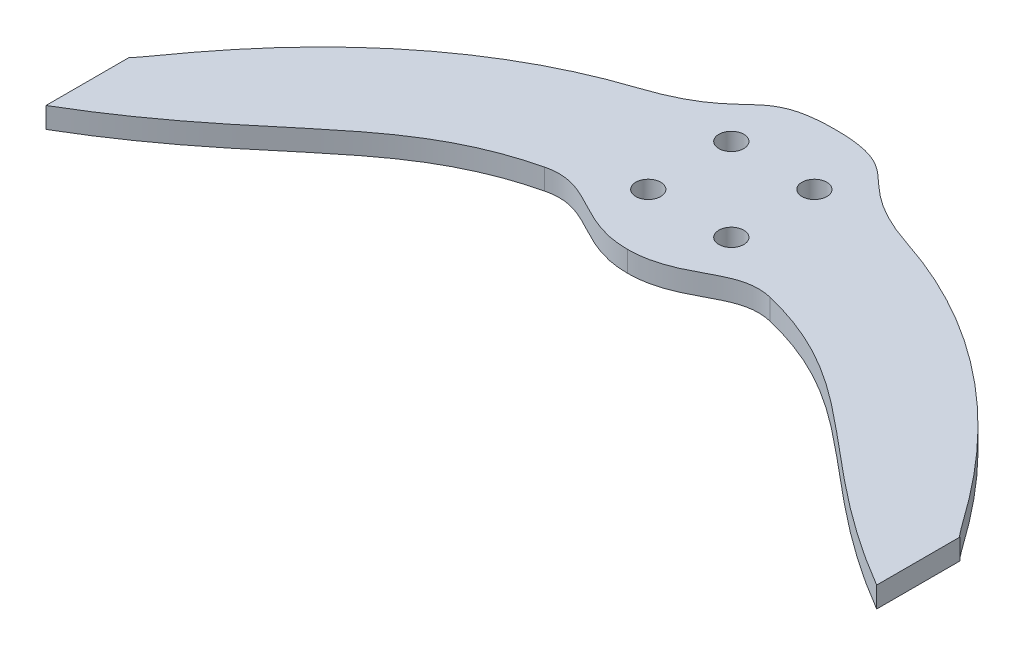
ISO-10303-21;
HEADER;
FILE_DESCRIPTION(('STEP AP214'),'2;1');
FILE_NAME('part.step','',(''),(''),'','','');
FILE_SCHEMA(('AUTOMOTIVE_DESIGN { 1 0 10303 214 1 1 1 1 }'));
ENDSEC;
DATA;
#1=APPLICATION_CONTEXT('core data for automotive mechanical design processes');
#2=APPLICATION_PROTOCOL_DEFINITION('international standard','automotive_design',2000,#1);
#3=PRODUCT_CONTEXT('',#1,'mechanical');
#4=PRODUCT('Part','Part','',(#3));
#5=PRODUCT_RELATED_PRODUCT_CATEGORY('part','',(#4));
#6=PRODUCT_DEFINITION_FORMATION('','',#4);
#7=PRODUCT_DEFINITION_CONTEXT('part definition',#1,'design');
#8=PRODUCT_DEFINITION('design','',#6,#7);
#9=PRODUCT_DEFINITION_SHAPE('','',#8);
#10=(LENGTH_UNIT() NAMED_UNIT(*) SI_UNIT(.MILLI.,.METRE.));
#11=(NAMED_UNIT(*) PLANE_ANGLE_UNIT() SI_UNIT($,.RADIAN.));
#12=(NAMED_UNIT(*) SI_UNIT($,.STERADIAN.) SOLID_ANGLE_UNIT());
#13=UNCERTAINTY_MEASURE_WITH_UNIT(LENGTH_MEASURE(1.E-05),#10,'distance_accuracy_value','');
#14=(GEOMETRIC_REPRESENTATION_CONTEXT(3) GLOBAL_UNCERTAINTY_ASSIGNED_CONTEXT((#13)) GLOBAL_UNIT_ASSIGNED_CONTEXT((#10,
#11,#12)) REPRESENTATION_CONTEXT('',''));
#15=CARTESIAN_POINT('',(0.,0.,0.));
#16=DIRECTION('',(0.,0.,1.));
#17=DIRECTION('',(1.,0.,0.));
#18=AXIS2_PLACEMENT_3D('',#15,#16,#17);
#19=CARTESIAN_POINT('',(-50.,2.5,0.));
#20=DIRECTION('',(1.,0.,0.));
#21=DIRECTION('',(0.,0.,-1.));
#22=AXIS2_PLACEMENT_3D('',#19,#20,#21);
#23=PLANE('',#22);
#24=DIRECTION('',(0.,0.,1.));
#25=VECTOR('',#24,1.);
#26=CARTESIAN_POINT('',(-50.,0.,0.));
#27=LINE('',#26,#25);
#28=CARTESIAN_POINT('',(-50.,0.,30.));
#29=VERTEX_POINT('',#28);
#30=CARTESIAN_POINT('',(-50.,0.,40.));
#31=VERTEX_POINT('',#30);
#32=EDGE_CURVE('E141',#29,#31,#27,.T.);
#33=ORIENTED_EDGE('',*,*,#32,.T.);
#34=DIRECTION('',(0.,-1.,0.));
#35=VECTOR('',#34,1.);
#36=CARTESIAN_POINT('',(-50.,2.5,40.));
#37=LINE('',#36,#35);
#38=CARTESIAN_POINT('',(-50.,2.5,40.));
#39=VERTEX_POINT('',#38);
#40=EDGE_CURVE('E11',#39,#31,#37,.T.);
#41=ORIENTED_EDGE('',*,*,#40,.F.);
#42=DIRECTION('',(0.,0.,1.));
#43=VECTOR('',#42,1.);
#44=CARTESIAN_POINT('',(-50.,2.5,0.));
#45=LINE('',#44,#43);
#46=CARTESIAN_POINT('',(-50.,2.5,30.));
#47=VERTEX_POINT('',#46);
#48=EDGE_CURVE('E228',#47,#39,#45,.T.);
#49=ORIENTED_EDGE('',*,*,#48,.F.);
#50=DIRECTION('',(0.,-1.,0.));
#51=VECTOR('',#50,1.);
#52=CARTESIAN_POINT('',(-50.,2.5,30.));
#53=LINE('',#52,#51);
#54=EDGE_CURVE('E191',#47,#29,#53,.T.);
#55=ORIENTED_EDGE('',*,*,#54,.T.);
#56=EDGE_LOOP('',(#33,#41,#49,#55));
#57=FACE_BOUND('',#56,.T.);
#58=ADVANCED_FACE('F40',(#57),#23,.F.);
#59=CARTESIAN_POINT('',(-50.,2.5,40.));
#60=CARTESIAN_POINT('',(-28.1511128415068,2.5,27.210470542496));
#61=CARTESIAN_POINT('',(-26.8264578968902,2.5,15.));
#62=CARTESIAN_POINT('',(0.,2.5,15.));
#63=B_SPLINE_CURVE_WITH_KNOTS('',3,(#59,#60,#61,#62),.UNSPECIFIED.,.F.,.F.,(4,4),(0.,1.),.UNSPECIFIED.);
#64=DIRECTION('',(0.,-1.,0.));
#65=VECTOR('',#64,1.);
#66=SURFACE_OF_LINEAR_EXTRUSION('',#63,#65);
#67=CARTESIAN_POINT('',(-50.,0.,40.));
#68=CARTESIAN_POINT('',(-28.1511128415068,0.,27.210470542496));
#69=CARTESIAN_POINT('',(-26.8264578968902,0.,15.));
#70=CARTESIAN_POINT('',(0.,0.,15.));
#71=B_SPLINE_CURVE_WITH_KNOTS('',3,(#67,#68,#69,#70),.UNSPECIFIED.,.F.,.F.,(4,4),(0.,1.),.UNSPECIFIED.);
#72=CARTESIAN_POINT('',(-13.5823718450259,0.,16.4153508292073));
#73=VERTEX_POINT('',#72);
#74=EDGE_CURVE('E202',#31,#73,#71,.T.);
#75=ORIENTED_EDGE('',*,*,#74,.T.);
#76=DIRECTION('',(0.,-1.,0.));
#77=VECTOR('',#76,1.);
#78=CARTESIAN_POINT('',(-13.5823718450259,2.5,16.4153508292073));
#79=LINE('',#78,#77);
#80=CARTESIAN_POINT('',(-13.5823718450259,2.5,16.4153508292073));
#81=VERTEX_POINT('',#80);
#82=EDGE_CURVE('E48',#81,#73,#79,.T.);
#83=ORIENTED_EDGE('',*,*,#82,.F.);
#84=EDGE_CURVE('E86',#39,#81,#63,.T.);
#85=ORIENTED_EDGE('',*,*,#84,.F.);
#86=ORIENTED_EDGE('',*,*,#40,.T.);
#87=EDGE_LOOP('',(#75,#83,#85,#86));
#88=FACE_BOUND('',#87,.T.);
#89=ADVANCED_FACE('F265',(#88),#66,.F.);
#90=CARTESIAN_POINT('',(-13.5849192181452,2.5,16.4159728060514));
#91=CARTESIAN_POINT('',(-8.61398085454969,2.5,15.2020759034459));
#92=CARTESIAN_POINT('',(-6.29609263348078,2.5,20.));
#93=CARTESIAN_POINT('',(0.,2.5,20.));
#94=B_SPLINE_CURVE_WITH_KNOTS('',3,(#90,#91,#92,#93),.UNSPECIFIED.,.F.,.F.,(4,4),(0.,1.),.UNSPECIFIED.);
#95=DIRECTION('',(0.,-1.,0.));
#96=VECTOR('',#95,1.);
#97=SURFACE_OF_LINEAR_EXTRUSION('',#94,#96);
#98=CARTESIAN_POINT('',(-13.5849192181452,0.,16.4159728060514));
#99=CARTESIAN_POINT('',(-8.61398085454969,0.,15.2020759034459));
#100=CARTESIAN_POINT('',(-6.29609263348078,0.,20.));
#101=CARTESIAN_POINT('',(0.,0.,20.));
#102=B_SPLINE_CURVE_WITH_KNOTS('',3,(#98,#99,#100,#101),.UNSPECIFIED.,.F.,.F.,(4,4),(0.,1.),.UNSPECIFIED.);
#103=CARTESIAN_POINT('',(0.,0.,20.));
#104=VERTEX_POINT('',#103);
#105=EDGE_CURVE('E206',#73,#104,#102,.T.);
#106=ORIENTED_EDGE('',*,*,#105,.T.);
#107=DIRECTION('',(0.,-1.,0.));
#108=VECTOR('',#107,1.);
#109=CARTESIAN_POINT('',(0.,2.5,20.));
#110=LINE('',#109,#108);
#111=CARTESIAN_POINT('',(0.,2.5,20.));
#112=VERTEX_POINT('',#111);
#113=EDGE_CURVE('E246',#112,#104,#110,.T.);
#114=ORIENTED_EDGE('',*,*,#113,.F.);
#115=EDGE_CURVE('E239',#81,#112,#94,.T.);
#116=ORIENTED_EDGE('',*,*,#115,.F.);
#117=ORIENTED_EDGE('',*,*,#82,.T.);
#118=EDGE_LOOP('',(#106,#114,#116,#117));
#119=FACE_BOUND('',#118,.T.);
#120=ADVANCED_FACE('F237',(#119),#97,.F.);
#121=CARTESIAN_POINT('',(-16.2793418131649,2.5,2.57520447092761));
#122=CARTESIAN_POINT('',(-5.87044346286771,2.5,-0.841962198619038));
#123=CARTESIAN_POINT('',(-9.22108648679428,2.5,-5.00000000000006));
#124=CARTESIAN_POINT('',(0.,2.5,-5.));
#125=B_SPLINE_CURVE_WITH_KNOTS('',3,(#121,#122,#123,#124),.UNSPECIFIED.,.F.,.F.,(4,4),(0.,1.),.UNSPECIFIED.);
#126=DIRECTION('',(0.,-1.,0.));
#127=VECTOR('',#126,1.);
#128=SURFACE_OF_LINEAR_EXTRUSION('',#125,#127);
#129=CARTESIAN_POINT('',(-16.2793418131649,0.,2.57520447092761));
#130=CARTESIAN_POINT('',(-5.87044346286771,0.,-0.841962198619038));
#131=CARTESIAN_POINT('',(-9.22108648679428,0.,-5.00000000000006));
#132=CARTESIAN_POINT('',(0.,0.,-5.));
#133=B_SPLINE_CURVE_WITH_KNOTS('',3,(#129,#130,#131,#132),.UNSPECIFIED.,.F.,.F.,(4,4),(0.,1.),.UNSPECIFIED.);
#134=CARTESIAN_POINT('',(-16.2724159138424,0.,2.5729312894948));
#135=VERTEX_POINT('',#134);
#136=CARTESIAN_POINT('',(0.,0.,-5.));
#137=VERTEX_POINT('',#136);
#138=EDGE_CURVE('E214',#135,#137,#133,.T.);
#139=ORIENTED_EDGE('',*,*,#138,.F.);
#140=DIRECTION('',(0.,-1.,0.));
#141=VECTOR('',#140,1.);
#142=CARTESIAN_POINT('',(-16.2724159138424,2.5,2.5729312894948));
#143=LINE('',#142,#141);
#144=CARTESIAN_POINT('',(-16.2724159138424,2.5,2.5729312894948));
#145=VERTEX_POINT('',#144);
#146=EDGE_CURVE('E76',#145,#135,#143,.T.);
#147=ORIENTED_EDGE('',*,*,#146,.F.);
#148=CARTESIAN_POINT('',(0.,2.5,-5.));
#149=VERTEX_POINT('',#148);
#150=EDGE_CURVE('E192',#145,#149,#125,.T.);
#151=ORIENTED_EDGE('',*,*,#150,.T.);
#152=DIRECTION('',(0.,-1.,0.));
#153=VECTOR('',#152,1.);
#154=CARTESIAN_POINT('',(0.,2.5,-5.));
#155=LINE('',#154,#153);
#156=EDGE_CURVE('E247',#149,#137,#155,.T.);
#157=ORIENTED_EDGE('',*,*,#156,.T.);
#158=EDGE_LOOP('',(#139,#147,#151,#157));
#159=FACE_BOUND('',#158,.T.);
#160=ADVANCED_FACE('F184',(#159),#128,.T.);
#161=CARTESIAN_POINT('',(0.,2.5,0.));
#162=CARTESIAN_POINT('',(-32.7342857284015,2.5,0.));
#163=CARTESIAN_POINT('',(-48.601729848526,2.5,29.1815044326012));
#164=CARTESIAN_POINT('',(-50.,2.5,30.));
#165=B_SPLINE_CURVE_WITH_KNOTS('',3,(#161,#162,#163,#164),.UNSPECIFIED.,.F.,.F.,(4,4),(0.,1.),.UNSPECIFIED.);
#166=DIRECTION('',(0.,-1.,0.));
#167=VECTOR('',#166,1.);
#168=SURFACE_OF_LINEAR_EXTRUSION('',#165,#167);
#169=CARTESIAN_POINT('',(0.,0.,0.));
#170=CARTESIAN_POINT('',(-32.7342857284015,0.,0.));
#171=CARTESIAN_POINT('',(-48.601729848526,0.,29.1815044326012));
#172=CARTESIAN_POINT('',(-50.,0.,30.));
#173=B_SPLINE_CURVE_WITH_KNOTS('',3,(#169,#170,#171,#172),.UNSPECIFIED.,.F.,.F.,(4,4),(0.,1.),.UNSPECIFIED.);
#174=EDGE_CURVE('E79',#135,#29,#173,.T.);
#175=ORIENTED_EDGE('',*,*,#174,.T.);
#176=ORIENTED_EDGE('',*,*,#54,.F.);
#177=EDGE_CURVE('E56',#145,#47,#165,.T.);
#178=ORIENTED_EDGE('',*,*,#177,.F.);
#179=ORIENTED_EDGE('',*,*,#146,.T.);
#180=EDGE_LOOP('',(#175,#176,#178,#179));
#181=FACE_BOUND('',#180,.T.);
#182=ADVANCED_FACE('F176',(#181),#168,.F.);
#183=CARTESIAN_POINT('',(0.,2.5,0.));
#184=DIRECTION('',(0.,1.,0.));
#185=DIRECTION('',(0.,0.,1.));
#186=AXIS2_PLACEMENT_3D('',#183,#184,#185);
#187=PLANE('',#186);
#188=CARTESIAN_POINT('',(5.,2.5,2.5));
#189=DIRECTION('',(0.,1.,0.));
#190=DIRECTION('',(0.,0.,1.));
#191=AXIS2_PLACEMENT_3D('',#188,#189,#190);
#192=CIRCLE('',#191,1.5);
#193=CARTESIAN_POINT('',(5.,2.5,4.));
#194=VERTEX_POINT('',#193);
#195=EDGE_CURVE('E496',#194,#194,#192,.T.);
#196=ORIENTED_EDGE('',*,*,#195,.F.);
#197=EDGE_LOOP('',(#196));
#198=FACE_BOUND('',#197,.T.);
#199=CARTESIAN_POINT('',(5.,2.5,12.5));
#200=DIRECTION('',(0.,1.,0.));
#201=DIRECTION('',(0.,0.,1.));
#202=AXIS2_PLACEMENT_3D('',#199,#200,#201);
#203=CIRCLE('',#202,1.5);
#204=CARTESIAN_POINT('',(5.,2.5,14.));
#205=VERTEX_POINT('',#204);
#206=EDGE_CURVE('E500',#205,#205,#203,.T.);
#207=ORIENTED_EDGE('',*,*,#206,.F.);
#208=EDGE_LOOP('',(#207));
#209=FACE_BOUND('',#208,.T.);
#210=CARTESIAN_POINT('',(-5.,2.5,12.5));
#211=DIRECTION('',(0.,1.,0.));
#212=DIRECTION('',(0.,0.,1.));
#213=AXIS2_PLACEMENT_3D('',#210,#211,#212);
#214=CIRCLE('',#213,1.5);
#215=CARTESIAN_POINT('',(-5.,2.5,14.));
#216=VERTEX_POINT('',#215);
#217=EDGE_CURVE('E509',#216,#216,#214,.T.);
#218=ORIENTED_EDGE('',*,*,#217,.F.);
#219=EDGE_LOOP('',(#218));
#220=FACE_BOUND('',#219,.T.);
#221=CARTESIAN_POINT('',(-5.,2.5,2.5));
#222=DIRECTION('',(0.,1.,0.));
#223=DIRECTION('',(0.,0.,1.));
#224=AXIS2_PLACEMENT_3D('',#221,#222,#223);
#225=CIRCLE('',#224,1.5);
#226=CARTESIAN_POINT('',(-5.,2.5,4.));
#227=VERTEX_POINT('',#226);
#228=EDGE_CURVE('E152',#227,#227,#225,.T.);
#229=ORIENTED_EDGE('',*,*,#228,.F.);
#230=EDGE_LOOP('',(#229));
#231=FACE_BOUND('',#230,.T.);
#232=ORIENTED_EDGE('',*,*,#48,.T.);
#233=ORIENTED_EDGE('',*,*,#84,.T.);
#234=ORIENTED_EDGE('',*,*,#115,.T.);
#235=CARTESIAN_POINT('',(13.5849192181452,2.5,16.4159728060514));
#236=CARTESIAN_POINT('',(8.61398085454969,2.5,15.2020759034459));
#237=CARTESIAN_POINT('',(6.29609263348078,2.5,20.));
#238=CARTESIAN_POINT('',(0.,2.5,20.));
#239=B_SPLINE_CURVE_WITH_KNOTS('',3,(#235,#236,#237,#238),.UNSPECIFIED.,.F.,.F.,(4,4),(0.,1.),.UNSPECIFIED.);
#240=CARTESIAN_POINT('',(13.5823718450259,2.5,16.4153508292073));
#241=VERTEX_POINT('',#240);
#242=EDGE_CURVE('E128',#241,#112,#239,.T.);
#243=ORIENTED_EDGE('',*,*,#242,.F.);
#244=CARTESIAN_POINT('',(50.,2.5,40.));
#245=CARTESIAN_POINT('',(28.1511128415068,2.5,27.210470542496));
#246=CARTESIAN_POINT('',(26.8264578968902,2.5,15.));
#247=CARTESIAN_POINT('',(0.,2.5,15.));
#248=B_SPLINE_CURVE_WITH_KNOTS('',3,(#244,#245,#246,#247),.UNSPECIFIED.,.F.,.F.,(4,4),(0.,1.),.UNSPECIFIED.);
#249=CARTESIAN_POINT('',(50.,2.5,40.));
#250=VERTEX_POINT('',#249);
#251=EDGE_CURVE('E121',#250,#241,#248,.T.);
#252=ORIENTED_EDGE('',*,*,#251,.F.);
#253=DIRECTION('',(0.,0.,1.));
#254=VECTOR('',#253,1.);
#255=CARTESIAN_POINT('',(50.,2.5,0.));
#256=LINE('',#255,#254);
#257=CARTESIAN_POINT('',(50.,2.5,30.));
#258=VERTEX_POINT('',#257);
#259=EDGE_CURVE('E125',#258,#250,#256,.T.);
#260=ORIENTED_EDGE('',*,*,#259,.F.);
#261=CARTESIAN_POINT('',(0.,2.5,0.));
#262=CARTESIAN_POINT('',(32.7342857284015,2.5,0.));
#263=CARTESIAN_POINT('',(48.601729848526,2.5,29.1815044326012));
#264=CARTESIAN_POINT('',(50.,2.5,30.));
#265=B_SPLINE_CURVE_WITH_KNOTS('',3,(#261,#262,#263,#264),.UNSPECIFIED.,.F.,.F.,(4,4),(0.,1.),.UNSPECIFIED.);
#266=CARTESIAN_POINT('',(16.2724159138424,2.5,2.5729312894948));
#267=VERTEX_POINT('',#266);
#268=EDGE_CURVE('E303',#267,#258,#265,.T.);
#269=ORIENTED_EDGE('',*,*,#268,.F.);
#270=CARTESIAN_POINT('',(16.2793418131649,2.5,2.57520447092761));
#271=CARTESIAN_POINT('',(5.87044346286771,2.5,-0.841962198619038));
#272=CARTESIAN_POINT('',(9.22108648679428,2.5,-5.00000000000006));
#273=CARTESIAN_POINT('',(0.,2.5,-5.));
#274=B_SPLINE_CURVE_WITH_KNOTS('',3,(#270,#271,#272,#273),.UNSPECIFIED.,.F.,.F.,(4,4),(0.,1.),.UNSPECIFIED.);
#275=EDGE_CURVE('E286',#267,#149,#274,.T.);
#276=ORIENTED_EDGE('',*,*,#275,.T.);
#277=ORIENTED_EDGE('',*,*,#150,.F.);
#278=ORIENTED_EDGE('',*,*,#177,.T.);
#279=EDGE_LOOP('',(#232,#233,#234,#243,#252,#260,#269,#276,#277,#278));
#280=FACE_BOUND('',#279,.T.);
#281=ADVANCED_FACE('F123',(#198,#209,#220,#231,#280),#187,.T.);
#282=CARTESIAN_POINT('',(0.,0.,0.));
#283=DIRECTION('',(0.,1.,0.));
#284=DIRECTION('',(0.,0.,1.));
#285=AXIS2_PLACEMENT_3D('',#282,#283,#284);
#286=PLANE('',#285);
#287=CARTESIAN_POINT('',(5.,0.,2.5));
#288=DIRECTION('',(0.,1.,0.));
#289=DIRECTION('',(0.,0.,1.));
#290=AXIS2_PLACEMENT_3D('',#287,#288,#289);
#291=CIRCLE('',#290,1.5);
#292=CARTESIAN_POINT('',(5.,0.,4.));
#293=VERTEX_POINT('',#292);
#294=EDGE_CURVE('E493',#293,#293,#291,.T.);
#295=ORIENTED_EDGE('',*,*,#294,.T.);
#296=EDGE_LOOP('',(#295));
#297=FACE_BOUND('',#296,.T.);
#298=CARTESIAN_POINT('',(5.,0.,12.5));
#299=DIRECTION('',(0.,1.,0.));
#300=DIRECTION('',(0.,0.,1.));
#301=AXIS2_PLACEMENT_3D('',#298,#299,#300);
#302=CIRCLE('',#301,1.5);
#303=CARTESIAN_POINT('',(5.,0.,14.));
#304=VERTEX_POINT('',#303);
#305=EDGE_CURVE('E497',#304,#304,#302,.T.);
#306=ORIENTED_EDGE('',*,*,#305,.T.);
#307=EDGE_LOOP('',(#306));
#308=FACE_BOUND('',#307,.T.);
#309=CARTESIAN_POINT('',(-5.,0.,12.5));
#310=DIRECTION('',(0.,1.,0.));
#311=DIRECTION('',(0.,0.,1.));
#312=AXIS2_PLACEMENT_3D('',#309,#310,#311);
#313=CIRCLE('',#312,1.5);
#314=CARTESIAN_POINT('',(-5.,0.,14.));
#315=VERTEX_POINT('',#314);
#316=EDGE_CURVE('E513',#315,#315,#313,.T.);
#317=ORIENTED_EDGE('',*,*,#316,.T.);
#318=EDGE_LOOP('',(#317));
#319=FACE_BOUND('',#318,.T.);
#320=CARTESIAN_POINT('',(-5.,0.,2.5));
#321=DIRECTION('',(0.,1.,0.));
#322=DIRECTION('',(0.,0.,1.));
#323=AXIS2_PLACEMENT_3D('',#320,#321,#322);
#324=CIRCLE('',#323,1.5);
#325=CARTESIAN_POINT('',(-5.,0.,4.));
#326=VERTEX_POINT('',#325);
#327=EDGE_CURVE('E504',#326,#326,#324,.T.);
#328=ORIENTED_EDGE('',*,*,#327,.T.);
#329=EDGE_LOOP('',(#328));
#330=FACE_BOUND('',#329,.T.);
#331=ORIENTED_EDGE('',*,*,#32,.F.);
#332=ORIENTED_EDGE('',*,*,#174,.F.);
#333=ORIENTED_EDGE('',*,*,#138,.T.);
#334=CARTESIAN_POINT('',(16.2793418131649,0.,2.57520447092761));
#335=CARTESIAN_POINT('',(5.87044346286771,0.,-0.841962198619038));
#336=CARTESIAN_POINT('',(9.22108648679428,0.,-5.00000000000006));
#337=CARTESIAN_POINT('',(0.,0.,-5.));
#338=B_SPLINE_CURVE_WITH_KNOTS('',3,(#334,#335,#336,#337),.UNSPECIFIED.,.F.,.F.,(4,4),(0.,1.),.UNSPECIFIED.);
#339=CARTESIAN_POINT('',(16.2724159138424,0.,2.5729312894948));
#340=VERTEX_POINT('',#339);
#341=EDGE_CURVE('E149',#340,#137,#338,.T.);
#342=ORIENTED_EDGE('',*,*,#341,.F.);
#343=CARTESIAN_POINT('',(0.,0.,0.));
#344=CARTESIAN_POINT('',(32.7342857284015,0.,0.));
#345=CARTESIAN_POINT('',(48.601729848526,0.,29.1815044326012));
#346=CARTESIAN_POINT('',(50.,0.,30.));
#347=B_SPLINE_CURVE_WITH_KNOTS('',3,(#343,#344,#345,#346),.UNSPECIFIED.,.F.,.F.,(4,4),(0.,1.),.UNSPECIFIED.);
#348=CARTESIAN_POINT('',(50.,0.,30.));
#349=VERTEX_POINT('',#348);
#350=EDGE_CURVE('E147',#340,#349,#347,.T.);
#351=ORIENTED_EDGE('',*,*,#350,.T.);
#352=DIRECTION('',(0.,0.,1.));
#353=VECTOR('',#352,1.);
#354=CARTESIAN_POINT('',(50.,0.,0.));
#355=LINE('',#354,#353);
#356=CARTESIAN_POINT('',(50.,0.,40.));
#357=VERTEX_POINT('',#356);
#358=EDGE_CURVE('E313',#349,#357,#355,.T.);
#359=ORIENTED_EDGE('',*,*,#358,.T.);
#360=CARTESIAN_POINT('',(50.,0.,40.));
#361=CARTESIAN_POINT('',(28.1511128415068,0.,27.210470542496));
#362=CARTESIAN_POINT('',(26.8264578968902,0.,15.));
#363=CARTESIAN_POINT('',(0.,0.,15.));
#364=B_SPLINE_CURVE_WITH_KNOTS('',3,(#360,#361,#362,#363),.UNSPECIFIED.,.F.,.F.,(4,4),(0.,1.),.UNSPECIFIED.);
#365=CARTESIAN_POINT('',(13.5823718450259,0.,16.4153508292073));
#366=VERTEX_POINT('',#365);
#367=EDGE_CURVE('E137',#357,#366,#364,.T.);
#368=ORIENTED_EDGE('',*,*,#367,.T.);
#369=CARTESIAN_POINT('',(13.5849192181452,0.,16.4159728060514));
#370=CARTESIAN_POINT('',(8.61398085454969,0.,15.2020759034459));
#371=CARTESIAN_POINT('',(6.29609263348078,0.,20.));
#372=CARTESIAN_POINT('',(0.,0.,20.));
#373=B_SPLINE_CURVE_WITH_KNOTS('',3,(#369,#370,#371,#372),.UNSPECIFIED.,.F.,.F.,(4,4),(0.,1.),.UNSPECIFIED.);
#374=EDGE_CURVE('E242',#366,#104,#373,.T.);
#375=ORIENTED_EDGE('',*,*,#374,.T.);
#376=ORIENTED_EDGE('',*,*,#105,.F.);
#377=ORIENTED_EDGE('',*,*,#74,.F.);
#378=EDGE_LOOP('',(#331,#332,#333,#342,#351,#359,#368,#375,#376,#377));
#379=FACE_BOUND('',#378,.T.);
#380=ADVANCED_FACE('F173',(#297,#308,#319,#330,#379),#286,.F.);
#381=CARTESIAN_POINT('',(50.,2.5,0.));
#382=DIRECTION('',(-1.,0.,0.));
#383=DIRECTION('',(0.,0.,-1.));
#384=AXIS2_PLACEMENT_3D('',#381,#382,#383);
#385=PLANE('',#384);
#386=ORIENTED_EDGE('',*,*,#358,.F.);
#387=DIRECTION('',(0.,-1.,0.));
#388=VECTOR('',#387,1.);
#389=CARTESIAN_POINT('',(50.,2.5,30.));
#390=LINE('',#389,#388);
#391=EDGE_CURVE('E146',#258,#349,#390,.T.);
#392=ORIENTED_EDGE('',*,*,#391,.F.);
#393=ORIENTED_EDGE('',*,*,#259,.T.);
#394=DIRECTION('',(0.,-1.,0.));
#395=VECTOR('',#394,1.);
#396=CARTESIAN_POINT('',(50.,2.5,40.));
#397=LINE('',#396,#395);
#398=EDGE_CURVE('E134',#250,#357,#397,.T.);
#399=ORIENTED_EDGE('',*,*,#398,.T.);
#400=EDGE_LOOP('',(#386,#392,#393,#399));
#401=FACE_BOUND('',#400,.T.);
#402=ADVANCED_FACE('F144',(#401),#385,.F.);
#403=DIRECTION('',(0.,-1.,0.));
#404=VECTOR('',#403,1.);
#405=SURFACE_OF_LINEAR_EXTRUSION('',#248,#404);
#406=ORIENTED_EDGE('',*,*,#367,.F.);
#407=ORIENTED_EDGE('',*,*,#398,.F.);
#408=ORIENTED_EDGE('',*,*,#251,.T.);
#409=DIRECTION('',(0.,-1.,0.));
#410=VECTOR('',#409,1.);
#411=CARTESIAN_POINT('',(13.5823718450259,2.5,16.4153508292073));
#412=LINE('',#411,#410);
#413=EDGE_CURVE('E142',#241,#366,#412,.T.);
#414=ORIENTED_EDGE('',*,*,#413,.T.);
#415=EDGE_LOOP('',(#406,#407,#408,#414));
#416=FACE_BOUND('',#415,.T.);
#417=ADVANCED_FACE('F135',(#416),#405,.T.);
#418=DIRECTION('',(0.,-1.,0.));
#419=VECTOR('',#418,1.);
#420=SURFACE_OF_LINEAR_EXTRUSION('',#239,#419);
#421=ORIENTED_EDGE('',*,*,#374,.F.);
#422=ORIENTED_EDGE('',*,*,#413,.F.);
#423=ORIENTED_EDGE('',*,*,#242,.T.);
#424=ORIENTED_EDGE('',*,*,#113,.T.);
#425=EDGE_LOOP('',(#421,#422,#423,#424));
#426=FACE_BOUND('',#425,.T.);
#427=ADVANCED_FACE('F169',(#426),#420,.T.);
#428=DIRECTION('',(0.,-1.,0.));
#429=VECTOR('',#428,1.);
#430=SURFACE_OF_LINEAR_EXTRUSION('',#274,#429);
#431=ORIENTED_EDGE('',*,*,#341,.T.);
#432=ORIENTED_EDGE('',*,*,#156,.F.);
#433=ORIENTED_EDGE('',*,*,#275,.F.);
#434=DIRECTION('',(0.,-1.,0.));
#435=VECTOR('',#434,1.);
#436=CARTESIAN_POINT('',(16.2724159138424,2.5,2.5729312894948));
#437=LINE('',#436,#435);
#438=EDGE_CURVE('E251',#267,#340,#437,.T.);
#439=ORIENTED_EDGE('',*,*,#438,.T.);
#440=EDGE_LOOP('',(#431,#432,#433,#439));
#441=FACE_BOUND('',#440,.T.);
#442=ADVANCED_FACE('F284',(#441),#430,.F.);
#443=DIRECTION('',(0.,-1.,0.));
#444=VECTOR('',#443,1.);
#445=SURFACE_OF_LINEAR_EXTRUSION('',#265,#444);
#446=ORIENTED_EDGE('',*,*,#350,.F.);
#447=ORIENTED_EDGE('',*,*,#438,.F.);
#448=ORIENTED_EDGE('',*,*,#268,.T.);
#449=ORIENTED_EDGE('',*,*,#391,.T.);
#450=EDGE_LOOP('',(#446,#447,#448,#449));
#451=FACE_BOUND('',#450,.T.);
#452=ADVANCED_FACE('F318',(#451),#445,.T.);
#453=CARTESIAN_POINT('',(-5.,0.,2.5));
#454=DIRECTION('',(0.,1.,0.));
#455=DIRECTION('',(0.,0.,1.));
#456=AXIS2_PLACEMENT_3D('',#453,#454,#455);
#457=CYLINDRICAL_SURFACE('',#456,1.5);
#458=ORIENTED_EDGE('',*,*,#327,.F.);
#459=EDGE_LOOP('',(#458));
#460=FACE_BOUND('',#459,.T.);
#461=ORIENTED_EDGE('',*,*,#228,.T.);
#462=EDGE_LOOP('',(#461));
#463=FACE_BOUND('',#462,.T.);
#464=ADVANCED_FACE('F321',(#460,#463),#457,.F.);
#465=CARTESIAN_POINT('',(-5.,0.,12.5));
#466=DIRECTION('',(0.,1.,0.));
#467=DIRECTION('',(0.,0.,1.));
#468=AXIS2_PLACEMENT_3D('',#465,#466,#467);
#469=CYLINDRICAL_SURFACE('',#468,1.5);
#470=ORIENTED_EDGE('',*,*,#316,.F.);
#471=EDGE_LOOP('',(#470));
#472=FACE_BOUND('',#471,.T.);
#473=ORIENTED_EDGE('',*,*,#217,.T.);
#474=EDGE_LOOP('',(#473));
#475=FACE_BOUND('',#474,.T.);
#476=ADVANCED_FACE('F446',(#472,#475),#469,.F.);
#477=CARTESIAN_POINT('',(5.,0.,12.5));
#478=DIRECTION('',(0.,1.,0.));
#479=DIRECTION('',(0.,0.,1.));
#480=AXIS2_PLACEMENT_3D('',#477,#478,#479);
#481=CYLINDRICAL_SURFACE('',#480,1.5);
#482=ORIENTED_EDGE('',*,*,#305,.F.);
#483=EDGE_LOOP('',(#482));
#484=FACE_BOUND('',#483,.T.);
#485=ORIENTED_EDGE('',*,*,#206,.T.);
#486=EDGE_LOOP('',(#485));
#487=FACE_BOUND('',#486,.T.);
#488=ADVANCED_FACE('F454',(#484,#487),#481,.F.);
#489=CARTESIAN_POINT('',(5.,0.,2.5));
#490=DIRECTION('',(0.,1.,0.));
#491=DIRECTION('',(0.,0.,1.));
#492=AXIS2_PLACEMENT_3D('',#489,#490,#491);
#493=CYLINDRICAL_SURFACE('',#492,1.5);
#494=ORIENTED_EDGE('',*,*,#294,.F.);
#495=EDGE_LOOP('',(#494));
#496=FACE_BOUND('',#495,.T.);
#497=ORIENTED_EDGE('',*,*,#195,.T.);
#498=EDGE_LOOP('',(#497));
#499=FACE_BOUND('',#498,.T.);
#500=ADVANCED_FACE('F464',(#496,#499),#493,.F.);
#501=CLOSED_SHELL('',(#58,#89,#120,#160,#182,#281,#380,#402,#417,#427,#442,#452,#464,#476,#488,#500));
#502=MANIFOLD_SOLID_BREP('B2',#501);
#503=ADVANCED_BREP_SHAPE_REPRESENTATION('',(#18,#502),#14);
#504=SHAPE_DEFINITION_REPRESENTATION(#9,#503);
ENDSEC;
END-ISO-10303-21;
